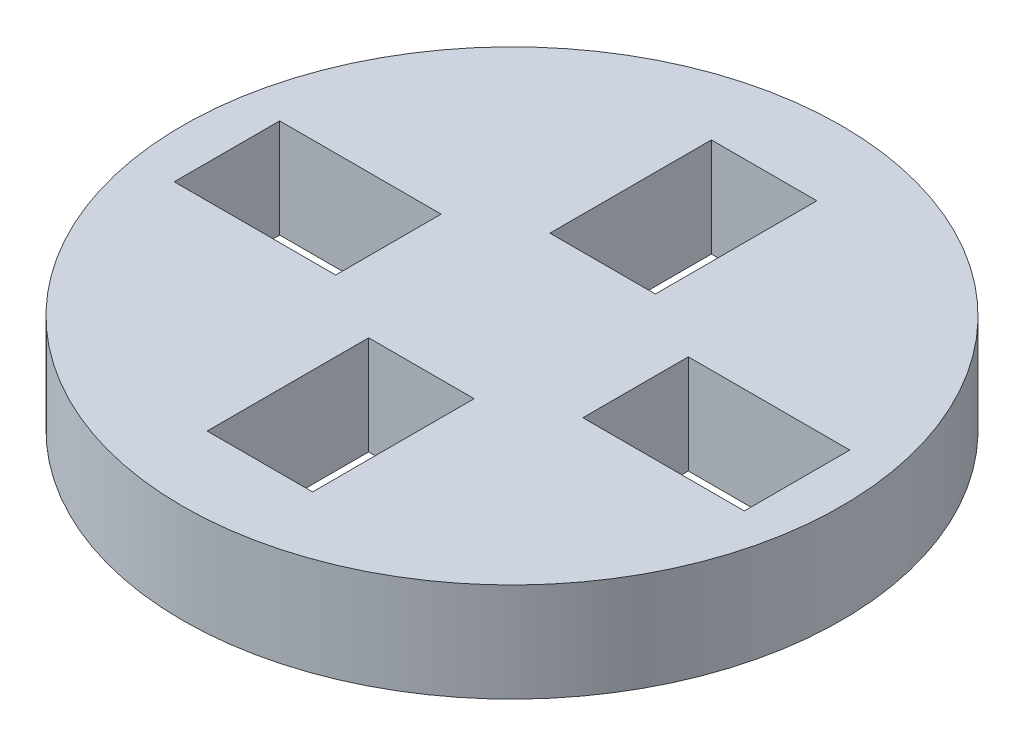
from build123d import *

# Parameters (mm, degrees)
SKETCH1_R           = 10
SKETCH1_W           = 4.9
SKETCH1_H           = 3.2
SKETCH1_W_2         = 3.2
SKETCH1_H_2         = 4.9
BOSS_EXTRUDE1_DEPTH = 3


with BuildPart() as part:
    # Sketch1 → Boss-Extrude1 (new body)
    with BuildSketch(Plane(origin=(0, 0, 0), x_dir=(1, 0, 0), z_dir=(0, 1, 0))):
        with Locations(Location((0, 0, 0), (0, 0, 270))):
            Circle(SKETCH1_R)
        with Locations((6.2, 0)):
            Rectangle(SKETCH1_W, SKETCH1_H, mode=Mode.SUBTRACT)
        with Locations((0, 5.2)):
            Rectangle(SKETCH1_W_2, SKETCH1_H_2, mode=Mode.SUBTRACT)
        with Locations((-6.2, 0)):
            Rectangle(SKETCH1_W, SKETCH1_H, mode=Mode.SUBTRACT)
        with Locations((0, -5.2)):
            Rectangle(SKETCH1_W_2, SKETCH1_H_2, mode=Mode.SUBTRACT)
    extrude(amount=BOSS_EXTRUDE1_DEPTH)


solid = part.part
